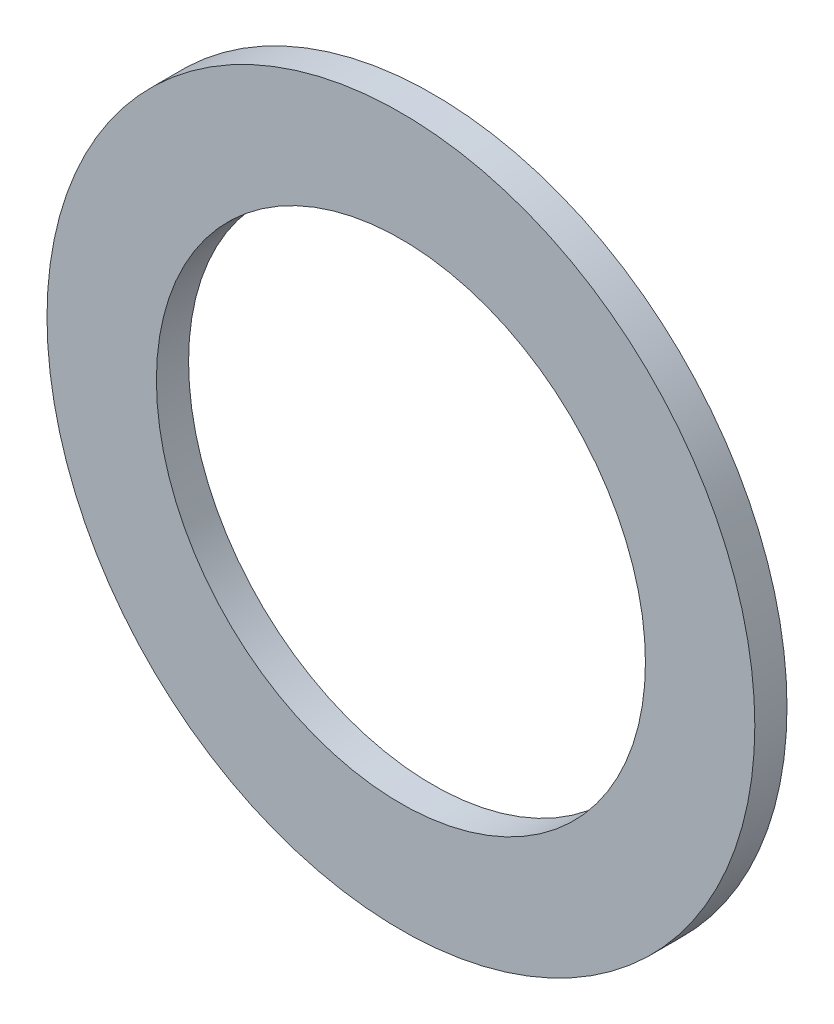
ISO-10303-21;
HEADER;
FILE_DESCRIPTION(('STEP AP214'),'2;1');
FILE_NAME('part.step','',(''),(''),'','','');
FILE_SCHEMA(('AUTOMOTIVE_DESIGN { 1 0 10303 214 1 1 1 1 }'));
ENDSEC;
DATA;
#1=APPLICATION_CONTEXT('core data for automotive mechanical design processes');
#2=APPLICATION_PROTOCOL_DEFINITION('international standard','automotive_design',2000,#1);
#3=PRODUCT_CONTEXT('',#1,'mechanical');
#4=PRODUCT('Part','Part','',(#3));
#5=PRODUCT_RELATED_PRODUCT_CATEGORY('part','',(#4));
#6=PRODUCT_DEFINITION_FORMATION('','',#4);
#7=PRODUCT_DEFINITION_CONTEXT('part definition',#1,'design');
#8=PRODUCT_DEFINITION('design','',#6,#7);
#9=PRODUCT_DEFINITION_SHAPE('','',#8);
#10=(LENGTH_UNIT() NAMED_UNIT(*) SI_UNIT(.MILLI.,.METRE.));
#11=(NAMED_UNIT(*) PLANE_ANGLE_UNIT() SI_UNIT($,.RADIAN.));
#12=(NAMED_UNIT(*) SI_UNIT($,.STERADIAN.) SOLID_ANGLE_UNIT());
#13=UNCERTAINTY_MEASURE_WITH_UNIT(LENGTH_MEASURE(1.E-05),#10,'distance_accuracy_value','');
#14=(GEOMETRIC_REPRESENTATION_CONTEXT(3) GLOBAL_UNCERTAINTY_ASSIGNED_CONTEXT((#13)) GLOBAL_UNIT_ASSIGNED_CONTEXT((#10,
#11,#12)) REPRESENTATION_CONTEXT('',''));
#15=CARTESIAN_POINT('',(0.,0.,0.));
#16=DIRECTION('',(0.,0.,1.));
#17=DIRECTION('',(1.,0.,0.));
#18=AXIS2_PLACEMENT_3D('',#15,#16,#17);
#19=CARTESIAN_POINT('',(0.,0.,5.));
#20=DIRECTION('',(0.,0.,1.));
#21=DIRECTION('',(1.,0.,0.));
#22=AXIS2_PLACEMENT_3D('',#19,#20,#21);
#23=PLANE('',#22);
#24=CARTESIAN_POINT('',(0.,0.,5.));
#25=DIRECTION('',(0.,0.,1.));
#26=DIRECTION('',(1.,0.,0.));
#27=AXIS2_PLACEMENT_3D('',#24,#25,#26);
#28=CIRCLE('',#27,55.);
#29=CARTESIAN_POINT('',(55.,0.,5.));
#30=VERTEX_POINT('',#29);
#31=EDGE_CURVE('E10',#30,#30,#28,.T.);
#32=ORIENTED_EDGE('',*,*,#31,.T.);
#33=EDGE_LOOP('',(#32));
#34=FACE_BOUND('',#33,.T.);
#35=CARTESIAN_POINT('',(0.,0.,5.));
#36=DIRECTION('',(0.,0.,1.));
#37=DIRECTION('',(1.,0.,0.));
#38=AXIS2_PLACEMENT_3D('',#35,#36,#37);
#39=CIRCLE('',#38,38.);
#40=CARTESIAN_POINT('',(38.,0.,5.));
#41=VERTEX_POINT('',#40);
#42=EDGE_CURVE('E45',#41,#41,#39,.T.);
#43=ORIENTED_EDGE('',*,*,#42,.F.);
#44=EDGE_LOOP('',(#43));
#45=FACE_BOUND('',#44,.T.);
#46=ADVANCED_FACE('F34',(#34,#45),#23,.T.);
#47=CARTESIAN_POINT('',(0.,0.,0.));
#48=DIRECTION('',(0.,0.,1.));
#49=DIRECTION('',(1.,0.,0.));
#50=AXIS2_PLACEMENT_3D('',#47,#48,#49);
#51=PLANE('',#50);
#52=CARTESIAN_POINT('',(0.,0.,0.));
#53=DIRECTION('',(0.,0.,1.));
#54=DIRECTION('',(1.,0.,0.));
#55=AXIS2_PLACEMENT_3D('',#52,#53,#54);
#56=CIRCLE('',#55,55.);
#57=CARTESIAN_POINT('',(55.,0.,0.));
#58=VERTEX_POINT('',#57);
#59=EDGE_CURVE('E41',#58,#58,#56,.T.);
#60=ORIENTED_EDGE('',*,*,#59,.F.);
#61=EDGE_LOOP('',(#60));
#62=FACE_BOUND('',#61,.T.);
#63=CARTESIAN_POINT('',(0.,0.,0.));
#64=DIRECTION('',(0.,0.,1.));
#65=DIRECTION('',(1.,0.,0.));
#66=AXIS2_PLACEMENT_3D('',#63,#64,#65);
#67=CIRCLE('',#66,38.);
#68=CARTESIAN_POINT('',(38.,0.,0.));
#69=VERTEX_POINT('',#68);
#70=EDGE_CURVE('E49',#69,#69,#67,.T.);
#71=ORIENTED_EDGE('',*,*,#70,.T.);
#72=EDGE_LOOP('',(#71));
#73=FACE_BOUND('',#72,.T.);
#74=ADVANCED_FACE('F55',(#62,#73),#51,.F.);
#75=CARTESIAN_POINT('',(0.,0.,5.));
#76=DIRECTION('',(0.,0.,-1.));
#77=DIRECTION('',(-1.,0.,0.));
#78=AXIS2_PLACEMENT_3D('',#75,#76,#77);
#79=CYLINDRICAL_SURFACE('',#78,55.);
#80=ORIENTED_EDGE('',*,*,#31,.F.);
#81=EDGE_LOOP('',(#80));
#82=FACE_BOUND('',#81,.T.);
#83=ORIENTED_EDGE('',*,*,#59,.T.);
#84=EDGE_LOOP('',(#83));
#85=FACE_BOUND('',#84,.T.);
#86=ADVANCED_FACE('F36',(#82,#85),#79,.T.);
#87=CARTESIAN_POINT('',(0.,0.,5.));
#88=DIRECTION('',(0.,0.,-1.));
#89=DIRECTION('',(-1.,0.,0.));
#90=AXIS2_PLACEMENT_3D('',#87,#88,#89);
#91=CYLINDRICAL_SURFACE('',#90,38.);
#92=ORIENTED_EDGE('',*,*,#42,.T.);
#93=EDGE_LOOP('',(#92));
#94=FACE_BOUND('',#93,.T.);
#95=ORIENTED_EDGE('',*,*,#70,.F.);
#96=EDGE_LOOP('',(#95));
#97=FACE_BOUND('',#96,.T.);
#98=ADVANCED_FACE('F57',(#94,#97),#91,.F.);
#99=CLOSED_SHELL('',(#46,#74,#86,#98));
#100=MANIFOLD_SOLID_BREP('B2',#99);
#101=ADVANCED_BREP_SHAPE_REPRESENTATION('',(#18,#100),#14);
#102=SHAPE_DEFINITION_REPRESENTATION(#9,#101);
ENDSEC;
END-ISO-10303-21;
